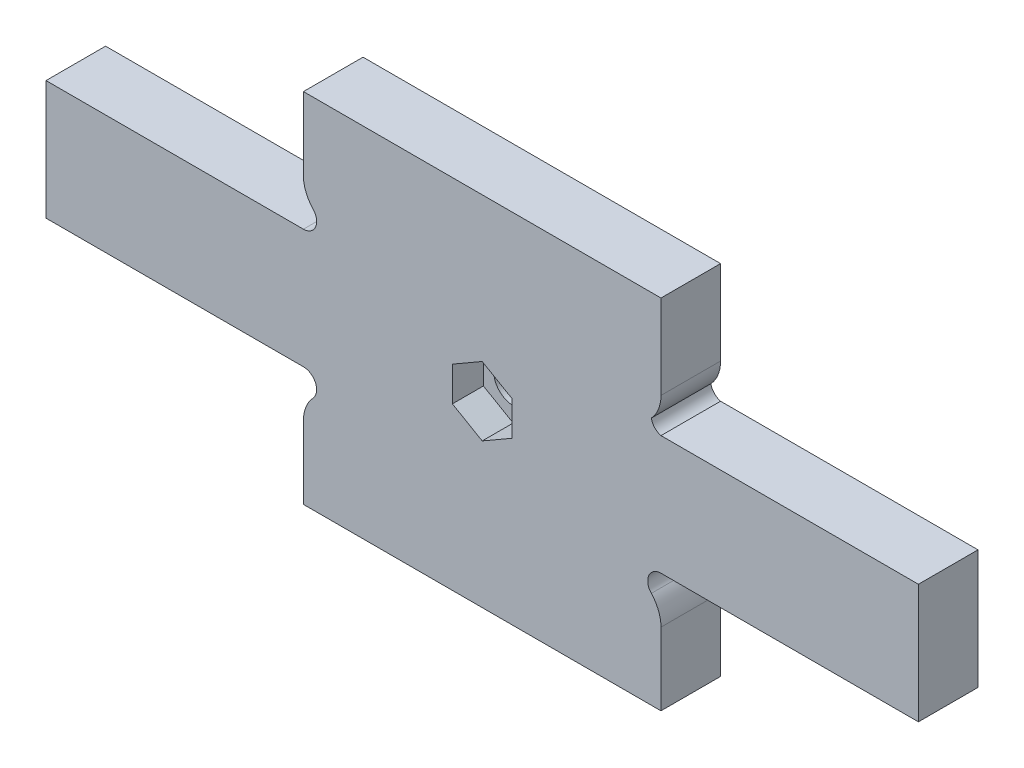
from build123d import *

# Parameters (mm, degrees)
BOSS_EXTRU_1_DEPTH      = 10
ESQUISSE2_R             = 3.25
ENL_V_MAT_EXTRU_1_DEPTH = 10
ENL_V_MAT_EXTRU_2_DEPTH = 5.2


with BuildPart() as part:
    # Esquisse1 → Boss.-Extru.1 (new body)
    with BuildSketch(Plane.XY):
        with BuildLine():
            Line((30, -10), (73.2, -10))
            Line((73.2, -10), (73.2, 10))
            Line((73.2, 10), (30, 10))
            ThreePointArc((30, 10), (28.937806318, 10.633704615), (28.379562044, 11.737425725))
            ThreePointArc((28.379562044, 11.737425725), (29.580204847, 13.633737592), (30, 15.838576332))
            Line((30, 15.838576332), (30, 30))
            Line((30, 30), (-30, 30))
            Line((-30, 30), (-30, 17.374003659))
            ThreePointArc((-30, 17.374003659), (-29.50020143, 15.417393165), (-28.379562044, 13.737425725))
            ThreePointArc((-28.379562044, 13.737425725), (-27.963202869, 11.336904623), (-30, 10))
            Line((-30, 10), (-73.2, 10))
            Line((-73.2, 10), (-73.2, -10))
            Line((-73.2, -10), (-30, -10))
            ThreePointArc((-30, -10), (-27.963202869, -11.336904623), (-28.379562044, -13.737425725))
            ThreePointArc((-28.379562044, -13.737425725), (-29.580204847, -15.633737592), (-30, -17.838576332))
            Line((-30, -17.838576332), (-30, -30))
            Line((-30, -30), (30, -30))
            Line((30, -30), (30, -17.838576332))
            ThreePointArc((30, -17.838576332), (29.580204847, -15.633737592), (28.379562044, -13.737425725))
            ThreePointArc((28.379562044, -13.737425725), (27.963202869, -11.336904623), (30, -10))
        make_face()
    extrude(amount=BOSS_EXTRU_1_DEPTH)

    # Esquisse2 → Enl_v. mat.-Extru.1 (cut)
    with BuildSketch(Plane.XY.offset(10)):
        Circle(ESQUISSE2_R)
    extrude(amount=-ENL_V_MAT_EXTRU_1_DEPTH, mode=Mode.SUBTRACT)

    # Esquisse3 → Enl_v. mat.-Extru.2 (cut)
    with BuildSketch(Plane.XY.offset(10)):
        Polygon((5, -2.886751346), (5, 2.886751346), (0, 5.773502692), (-5, 2.886751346), (-5, -2.886751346), (0, -5.773502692), align=None)
    extrude(amount=-ENL_V_MAT_EXTRU_2_DEPTH, mode=Mode.SUBTRACT)


solid = part.part
